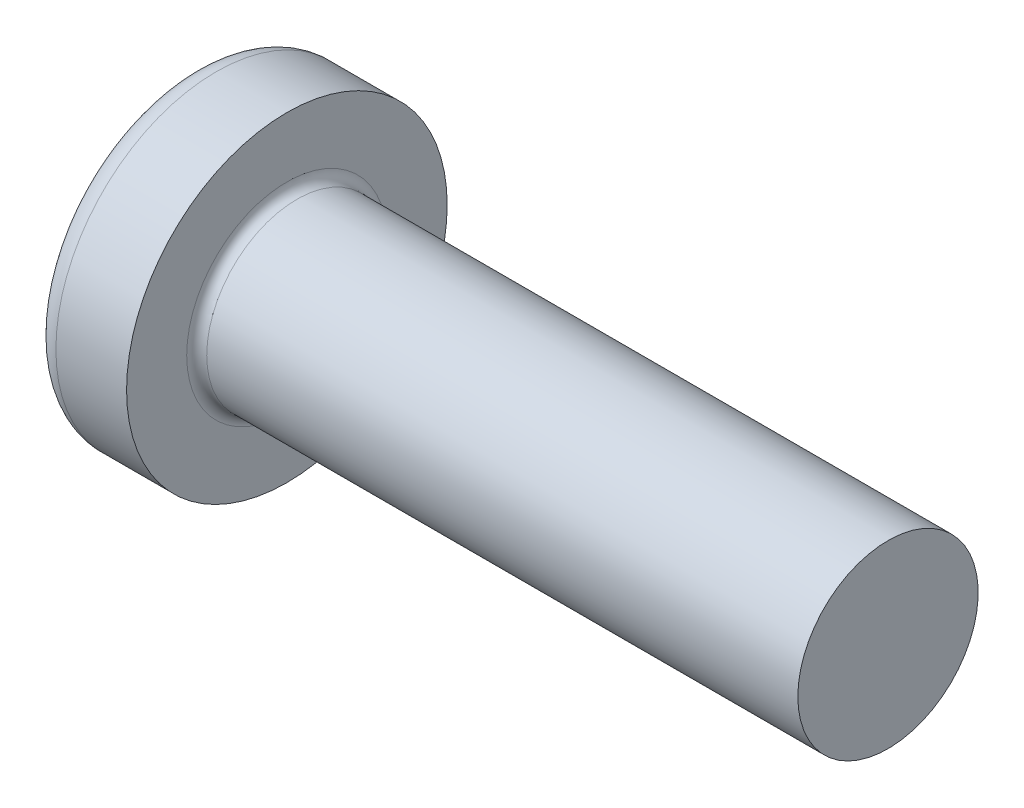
ISO-10303-21;
HEADER;
FILE_DESCRIPTION(('STEP AP214'),'2;1');
FILE_NAME('part.step','',(''),(''),'','','');
FILE_SCHEMA(('AUTOMOTIVE_DESIGN { 1 0 10303 214 1 1 1 1 }'));
ENDSEC;
DATA;
#1=APPLICATION_CONTEXT('core data for automotive mechanical design processes');
#2=APPLICATION_PROTOCOL_DEFINITION('international standard','automotive_design',2000,#1);
#3=PRODUCT_CONTEXT('',#1,'mechanical');
#4=PRODUCT('Part','Part','',(#3));
#5=PRODUCT_RELATED_PRODUCT_CATEGORY('part','',(#4));
#6=PRODUCT_DEFINITION_FORMATION('','',#4);
#7=PRODUCT_DEFINITION_CONTEXT('part definition',#1,'design');
#8=PRODUCT_DEFINITION('design','',#6,#7);
#9=PRODUCT_DEFINITION_SHAPE('','',#8);
#10=(LENGTH_UNIT() NAMED_UNIT(*) SI_UNIT(.MILLI.,.METRE.));
#11=(NAMED_UNIT(*) PLANE_ANGLE_UNIT() SI_UNIT($,.RADIAN.));
#12=(NAMED_UNIT(*) SI_UNIT($,.STERADIAN.) SOLID_ANGLE_UNIT());
#13=UNCERTAINTY_MEASURE_WITH_UNIT(LENGTH_MEASURE(1.E-05),#10,'distance_accuracy_value','');
#14=(GEOMETRIC_REPRESENTATION_CONTEXT(3) GLOBAL_UNCERTAINTY_ASSIGNED_CONTEXT((#13)) GLOBAL_UNIT_ASSIGNED_CONTEXT((#10,
#11,#12)) REPRESENTATION_CONTEXT('',''));
#15=CARTESIAN_POINT('',(0.,0.,0.));
#16=DIRECTION('',(0.,0.,1.));
#17=DIRECTION('',(1.,0.,0.));
#18=AXIS2_PLACEMENT_3D('',#15,#16,#17);
#19=CARTESIAN_POINT('',(0.999999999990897,0.,0.));
#20=DIRECTION('',(-1.,0.,0.));
#21=DIRECTION('',(0.,-1.,0.));
#22=AXIS2_PLACEMENT_3D('',#19,#20,#21);
#23=CONICAL_SURFACE('',#22,0.55599999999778,1.2566370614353);
#24=CARTESIAN_POINT('',(1.18065535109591,0.,2.66453525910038E-12));
#25=VERTEX_POINT('',#24);
#26=VERTEX_LOOP('',#25);
#27=FACE_BOUND('',#26,.T.);
#28=CARTESIAN_POINT('',(0.999999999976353,0.,0.));
#29=DIRECTION('',(-1.,0.,0.));
#30=DIRECTION('',(0.,0.,1.));
#31=AXIS2_PLACEMENT_3D('',#28,#29,#30);
#32=CIRCLE('',#31,0.555999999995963);
#33=CARTESIAN_POINT('',(0.999999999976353,0.,0.555999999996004));
#34=VERTEX_POINT('',#33);
#35=EDGE_CURVE('E284',#34,#34,#32,.T.);
#36=ORIENTED_EDGE('',*,*,#35,.T.);
#37=EDGE_LOOP('',(#36));
#38=FACE_BOUND('',#37,.T.);
#39=ADVANCED_FACE('F16',(#27,#38),#23,.F.);
#40=CARTESIAN_POINT('',(0.999999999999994,0.381418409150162,-0.299999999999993));
#41=DIRECTION('',(0.,0.,1.));
#42=DIRECTION('',(0.,-1.,0.));
#43=AXIS2_PLACEMENT_3D('',#40,#41,#42);
#44=PLANE('',#43);
#45=CARTESIAN_POINT('',(0.791562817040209,-0.485341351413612,-0.299999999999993));
#46=CARTESIAN_POINT('',(0.667770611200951,-0.495508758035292,-0.299999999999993));
#47=CARTESIAN_POINT('',(0.543972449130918,-0.505602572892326,-0.299999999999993));
#48=CARTESIAN_POINT('',(0.296364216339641,-0.525643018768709,-0.299999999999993));
#49=CARTESIAN_POINT('',(0.172554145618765,-0.535589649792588,-0.299999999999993));
#50=CARTESIAN_POINT('',(0.048738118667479,-0.545462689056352,-0.299999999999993));
#51=B_SPLINE_CURVE_WITH_KNOTS('',3,(#45,#46,#47,#48,#49,#50),.UNSPECIFIED.,.F.,.F.,(4,2,4),(0.,
0.372626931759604,0.745253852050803),.UNSPECIFIED.);
#52=CARTESIAN_POINT('',(0.791562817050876,-0.485341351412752,-0.299999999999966));
#53=VERTEX_POINT('',#52);
#54=CARTESIAN_POINT('',(0.048738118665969,-0.545462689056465,-0.299999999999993));
#55=VERTEX_POINT('',#54);
#56=EDGE_CURVE('E231',#53,#55,#51,.T.);
#57=ORIENTED_EDGE('',*,*,#56,.T.);
#58=CARTESIAN_POINT('',(0.0987409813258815,-0.830769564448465,-0.299999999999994));
#59=CARTESIAN_POINT('',(0.0886800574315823,-0.783521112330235,-0.299999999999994));
#60=CARTESIAN_POINT('',(0.0794826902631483,-0.736121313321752,-0.299999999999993));
#61=CARTESIAN_POINT('',(0.0628150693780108,-0.641019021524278,-0.299999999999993));
#62=CARTESIAN_POINT('',(0.0553448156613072,-0.593316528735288,-0.299999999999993));
#63=CARTESIAN_POINT('',(0.0487381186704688,-0.545462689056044,-0.299999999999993));
#64=B_SPLINE_CURVE_WITH_KNOTS('',3,(#58,#59,#60,#61,#62,#63),.UNSPECIFIED.,.F.,.F.,(4,2,4),(0.,
0.144851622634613,0.289703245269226),.UNSPECIFIED.);
#65=CARTESIAN_POINT('',(0.0987409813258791,-0.830769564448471,-0.299999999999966));
#66=VERTEX_POINT('',#65);
#67=EDGE_CURVE('E247',#66,#55,#64,.T.);
#68=ORIENTED_EDGE('',*,*,#67,.F.);
#69=DIRECTION('',(0.89493436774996,0.446197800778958,0.));
#70=VECTOR('',#69,1.);
#71=CARTESIAN_POINT('',(0.999999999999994,-0.381418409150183,-0.299999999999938));
#72=LINE('',#71,#70);
#73=EDGE_CURVE('E257',#66,#53,#72,.T.);
#74=ORIENTED_EDGE('',*,*,#73,.T.);
#75=EDGE_LOOP('',(#57,#68,#74));
#76=FACE_BOUND('',#75,.T.);
#77=ADVANCED_FACE('F239',(#76),#44,.T.);
#78=CARTESIAN_POINT('',(0.999999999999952,-0.300000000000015,-0.381418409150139));
#79=DIRECTION('',(0.,1.,0.));
#80=DIRECTION('',(0.,0.,1.));
#81=AXIS2_PLACEMENT_3D('',#78,#79,#80);
#82=PLANE('',#81);
#83=CARTESIAN_POINT('',(0.0487381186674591,-0.300000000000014,-0.545462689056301));
#84=CARTESIAN_POINT('',(0.172554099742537,-0.300000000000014,-0.53558965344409));
#85=CARTESIAN_POINT('',(0.296364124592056,-0.300000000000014,-0.525643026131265));
#86=CARTESIAN_POINT('',(0.543972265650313,-0.300000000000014,-0.505602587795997));
#87=CARTESIAN_POINT('',(0.667770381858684,-0.300000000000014,-0.495508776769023));
#88=CARTESIAN_POINT('',(0.79156254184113,-0.300000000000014,-0.485341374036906));
#89=B_SPLINE_CURVE_WITH_KNOTS('',3,(#83,#84,#85,#86,#87,#88),.UNSPECIFIED.,.F.,.F.,(4,2,4),(0.,
0.372626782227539,0.745253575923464),.UNSPECIFIED.);
#90=CARTESIAN_POINT('',(0.0487381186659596,-0.300000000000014,-0.545462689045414));
#91=VERTEX_POINT('',#90);
#92=CARTESIAN_POINT('',(0.79156267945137,-0.300000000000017,-0.485341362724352));
#93=VERTEX_POINT('',#92);
#94=EDGE_CURVE('E225',#91,#93,#89,.T.);
#95=ORIENTED_EDGE('',*,*,#94,.T.);
#96=DIRECTION('',(-0.894934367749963,0.,-0.446197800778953));
#97=VECTOR('',#96,1.);
#98=CARTESIAN_POINT('',(0.999999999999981,-0.30000000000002,-0.381418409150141));
#99=LINE('',#98,#97);
#100=CARTESIAN_POINT('',(0.0987409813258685,-0.300000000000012,-0.830769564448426));
#101=VERTEX_POINT('',#100);
#102=EDGE_CURVE('E282',#93,#101,#99,.T.);
#103=ORIENTED_EDGE('',*,*,#102,.T.);
#104=CARTESIAN_POINT('',(4.,-0.300000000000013,0.));
#105=DIRECTION('',(0.,1.,0.));
#106=DIRECTION('',(0.,0.,1.));
#107=AXIS2_PLACEMENT_3D('',#104,#105,#106);
#108=CIRCLE('',#107,3.98873413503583);
#109=EDGE_CURVE('E568',#91,#101,#108,.F.);
#110=ORIENTED_EDGE('',*,*,#109,.F.);
#111=EDGE_LOOP('',(#95,#103,#110));
#112=FACE_BOUND('',#111,.T.);
#113=ADVANCED_FACE('F235',(#112),#82,.T.);
#114=CARTESIAN_POINT('',(0.99999999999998,0.299999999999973,-0.381418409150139));
#115=DIRECTION('',(0.446197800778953,0.,-0.894934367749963));
#116=DIRECTION('',(-0.894934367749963,0.,-0.446197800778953));
#117=AXIS2_PLACEMENT_3D('',#114,#115,#116);
#118=PLANE('',#117);
#119=DIRECTION('',(0.894934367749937,0.,0.446197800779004));
#120=VECTOR('',#119,1.);
#121=CARTESIAN_POINT('',(0.0987409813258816,0.299999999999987,-0.830769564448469));
#122=LINE('',#121,#120);
#123=CARTESIAN_POINT('',(0.0987409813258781,0.299999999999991,-0.830769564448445));
#124=VERTEX_POINT('',#123);
#125=CARTESIAN_POINT('',(0.79156281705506,0.299999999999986,-0.485341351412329));
#126=VERTEX_POINT('',#125);
#127=EDGE_CURVE('E279',#124,#126,#122,.T.);
#128=ORIENTED_EDGE('',*,*,#127,.F.);
#129=CARTESIAN_POINT('',(0.0987409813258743,-0.30000000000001,-0.830769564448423));
#130=CARTESIAN_POINT('',(0.0917996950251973,-0.20000000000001,-0.834230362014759));
#131=CARTESIAN_POINT('',(0.0883290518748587,-0.100000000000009,-0.835960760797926));
#132=CARTESIAN_POINT('',(0.0883290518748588,0.0999999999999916,-0.835960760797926));
#133=CARTESIAN_POINT('',(0.0917996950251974,0.199999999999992,-0.834230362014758));
#134=CARTESIAN_POINT('',(0.0987409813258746,0.299999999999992,-0.830769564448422));
#135=B_SPLINE_CURVE_WITH_KNOTS('',3,(#129,#130,#131,#132,#133,#134),.UNSPECIFIED.,.F.,.F.,(4,2,
4),(0.,0.30022550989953,0.60045101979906),.UNSPECIFIED.);
#136=EDGE_CURVE('E146',#101,#124,#135,.T.);
#137=ORIENTED_EDGE('',*,*,#136,.F.);
#138=ORIENTED_EDGE('',*,*,#102,.F.);
#139=CARTESIAN_POINT('',(1.62081539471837,0.,-0.071891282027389));
#140=DIRECTION('',(0.446197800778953,0.,-0.894934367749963));
#141=DIRECTION('',(-0.894934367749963,0.,-0.446197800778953));
#142=AXIS2_PLACEMENT_3D('',#139,#140,#141);
#143=ELLIPSE('',#142,1.14879176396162,0.507521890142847);
#144=EDGE_CURVE('E230',#93,#126,#143,.T.);
#145=ORIENTED_EDGE('',*,*,#144,.T.);
#146=EDGE_LOOP('',(#128,#137,#138,#145));
#147=FACE_BOUND('',#146,.T.);
#148=ADVANCED_FACE('F238',(#147),#118,.F.);
#149=CARTESIAN_POINT('',(1.00000000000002,0.299999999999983,0.381418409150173));
#150=DIRECTION('',(0.,-1.,0.));
#151=DIRECTION('',(0.,0.,-1.));
#152=AXIS2_PLACEMENT_3D('',#149,#150,#151);
#153=PLANE('',#152);
#154=CARTESIAN_POINT('',(0.79156281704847,0.299999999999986,-0.48534135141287));
#155=CARTESIAN_POINT('',(0.667770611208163,0.299999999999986,-0.495508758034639));
#156=CARTESIAN_POINT('',(0.54397244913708,0.299999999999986,-0.505602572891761));
#157=CARTESIAN_POINT('',(0.296364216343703,0.299999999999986,-0.525643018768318));
#158=CARTESIAN_POINT('',(0.172554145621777,0.299999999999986,-0.535589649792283));
#159=CARTESIAN_POINT('',(0.0487381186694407,0.299999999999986,-0.54546268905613));
#160=B_SPLINE_CURVE_WITH_KNOTS('',3,(#154,#155,#156,#157,#158,#159),.UNSPECIFIED.,.F.,.F.,(4,2,
4),(0.,0.372626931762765,0.745253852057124),.UNSPECIFIED.);
#161=CARTESIAN_POINT('',(0.04873811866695,0.299999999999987,-0.545462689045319));
#162=VERTEX_POINT('',#161);
#163=EDGE_CURVE('E139',#126,#162,#160,.T.);
#164=ORIENTED_EDGE('',*,*,#163,.T.);
#165=CARTESIAN_POINT('',(4.,0.299999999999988,0.));
#166=DIRECTION('',(0.,1.,0.));
#167=DIRECTION('',(0.,0.,1.));
#168=AXIS2_PLACEMENT_3D('',#165,#166,#167);
#169=CIRCLE('',#168,3.98873413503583);
#170=EDGE_CURVE('E126',#124,#162,#169,.T.);
#171=ORIENTED_EDGE('',*,*,#170,.F.);
#172=ORIENTED_EDGE('',*,*,#127,.T.);
#173=EDGE_LOOP('',(#164,#171,#172));
#174=FACE_BOUND('',#173,.T.);
#175=ADVANCED_FACE('F167',(#174),#153,.T.);
#176=CARTESIAN_POINT('',(0.999999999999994,0.381418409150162,-0.299999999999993));
#177=DIRECTION('',(0.,0.,1.));
#178=DIRECTION('',(0.,-1.,0.));
#179=AXIS2_PLACEMENT_3D('',#176,#177,#178);
#180=PLANE('',#179);
#181=CARTESIAN_POINT('',(0.0487381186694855,0.54546268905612,-0.299999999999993));
#182=CARTESIAN_POINT('',(0.172554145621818,0.535589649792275,-0.299999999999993));
#183=CARTESIAN_POINT('',(0.296364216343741,0.525643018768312,-0.299999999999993));
#184=CARTESIAN_POINT('',(0.543972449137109,0.505602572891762,-0.299999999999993));
#185=CARTESIAN_POINT('',(0.667770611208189,0.495508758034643,-0.299999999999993));
#186=CARTESIAN_POINT('',(0.791562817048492,0.485341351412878,-0.299999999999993));
#187=B_SPLINE_CURVE_WITH_KNOTS('',3,(#181,#182,#183,#184,#185,#186),.UNSPECIFIED.,.F.,.F.,(4,2,
4),(0.,0.372626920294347,0.7452538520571),.UNSPECIFIED.);
#188=CARTESIAN_POINT('',(0.0487381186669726,0.545462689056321,-0.299999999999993));
#189=VERTEX_POINT('',#188);
#190=CARTESIAN_POINT('',(0.7915628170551,0.485341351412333,-0.299999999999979));
#191=VERTEX_POINT('',#190);
#192=EDGE_CURVE('E130',#189,#191,#187,.T.);
#193=ORIENTED_EDGE('',*,*,#192,.T.);
#194=DIRECTION('',(-0.89493436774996,0.446197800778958,0.));
#195=VECTOR('',#194,1.);
#196=CARTESIAN_POINT('',(1.00000000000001,0.381418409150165,-0.299999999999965));
#197=LINE('',#196,#195);
#198=CARTESIAN_POINT('',(0.0987409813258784,0.830769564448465,-0.299999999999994));
#199=VERTEX_POINT('',#198);
#200=EDGE_CURVE('E138',#191,#199,#197,.T.);
#201=ORIENTED_EDGE('',*,*,#200,.T.);
#202=CARTESIAN_POINT('',(0.0487381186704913,0.545462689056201,-0.299999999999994));
#203=CARTESIAN_POINT('',(0.0553448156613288,0.593316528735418,-0.299999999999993));
#204=CARTESIAN_POINT('',(0.0628150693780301,0.641019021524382,-0.299999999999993));
#205=CARTESIAN_POINT('',(0.0794826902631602,0.736121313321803,-0.299999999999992));
#206=CARTESIAN_POINT('',(0.088680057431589,0.78352111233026,-0.299999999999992));
#207=CARTESIAN_POINT('',(0.0987409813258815,0.830769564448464,-0.299999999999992));
#208=B_SPLINE_CURVE_WITH_KNOTS('',3,(#202,#203,#204,#205,#206,#207),.UNSPECIFIED.,.F.,.F.,(4,2,
4),(0.,0.144851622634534,0.289703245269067),.UNSPECIFIED.);
#209=EDGE_CURVE('E123',#189,#199,#208,.T.);
#210=ORIENTED_EDGE('',*,*,#209,.F.);
#211=EDGE_LOOP('',(#193,#201,#210));
#212=FACE_BOUND('',#211,.T.);
#213=ADVANCED_FACE('F141',(#212),#180,.T.);
#214=CARTESIAN_POINT('',(1.00000000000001,0.381418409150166,0.30000000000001));
#215=DIRECTION('',(0.446197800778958,0.89493436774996,0.));
#216=DIRECTION('',(-0.89493436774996,0.446197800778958,0.));
#217=AXIS2_PLACEMENT_3D('',#214,#215,#216);
#218=PLANE('',#217);
#219=DIRECTION('',(0.894934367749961,-0.446197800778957,0.));
#220=VECTOR('',#219,1.);
#221=CARTESIAN_POINT('',(0.0987409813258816,0.830769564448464,0.300000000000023));
#222=LINE('',#221,#220);
#223=CARTESIAN_POINT('',(0.0987409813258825,0.830769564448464,0.300000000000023));
#224=VERTEX_POINT('',#223);
#225=CARTESIAN_POINT('',(0.791562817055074,0.48534135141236,0.300000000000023));
#226=VERTEX_POINT('',#225);
#227=EDGE_CURVE('E275',#224,#226,#222,.T.);
#228=ORIENTED_EDGE('',*,*,#227,.F.);
#229=CARTESIAN_POINT('',(0.0987409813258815,0.830769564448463,-0.299999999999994));
#230=CARTESIAN_POINT('',(0.0917996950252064,0.834230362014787,-0.199999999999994));
#231=CARTESIAN_POINT('',(0.0883290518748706,0.835960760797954,-0.0999999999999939));
#232=CARTESIAN_POINT('',(0.0883290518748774,0.835960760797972,0.100000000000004));
#233=CARTESIAN_POINT('',(0.0917996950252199,0.834230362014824,0.200000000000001));
#234=CARTESIAN_POINT('',(0.0987409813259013,0.830769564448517,0.299999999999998));
#235=B_SPLINE_CURVE_WITH_KNOTS('',3,(#229,#230,#231,#232,#233,#234),.UNSPECIFIED.,.F.,.F.,(4,2,
4),(0.,0.300225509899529,0.600451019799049),.UNSPECIFIED.);
#236=EDGE_CURVE('E142',#199,#224,#235,.T.);
#237=ORIENTED_EDGE('',*,*,#236,.F.);
#238=ORIENTED_EDGE('',*,*,#200,.F.);
#239=CARTESIAN_POINT('',(1.62081539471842,0.0718912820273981,0.));
#240=DIRECTION('',(0.446197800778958,0.89493436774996,0.));
#241=DIRECTION('',(-0.89493436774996,0.446197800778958,0.));
#242=AXIS2_PLACEMENT_3D('',#239,#240,#241);
#243=ELLIPSE('',#242,1.1487917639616,0.507521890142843);
#244=EDGE_CURVE('E134',#226,#191,#243,.F.);
#245=ORIENTED_EDGE('',*,*,#244,.F.);
#246=EDGE_LOOP('',(#228,#237,#238,#245));
#247=FACE_BOUND('',#246,.T.);
#248=ADVANCED_FACE('F166',(#247),#218,.F.);
#249=CARTESIAN_POINT('',(0.999999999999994,-0.38141840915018,0.300000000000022));
#250=DIRECTION('',(0.,0.,-1.));
#251=DIRECTION('',(0.,1.,0.));
#252=AXIS2_PLACEMENT_3D('',#249,#250,#251);
#253=PLANE('',#252);
#254=CARTESIAN_POINT('',(0.791562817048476,0.485341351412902,0.300000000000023));
#255=CARTESIAN_POINT('',(0.667770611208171,0.49550875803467,0.300000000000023));
#256=CARTESIAN_POINT('',(0.543972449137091,0.505602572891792,0.300000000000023));
#257=CARTESIAN_POINT('',(0.29636421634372,0.525643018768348,0.300000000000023));
#258=CARTESIAN_POINT('',(0.172554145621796,0.535589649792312,0.300000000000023));
#259=CARTESIAN_POINT('',(0.0487381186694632,0.545462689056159,0.300000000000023));
#260=B_SPLINE_CURVE_WITH_KNOTS('',3,(#254,#255,#256,#257,#258,#259),.UNSPECIFIED.,.F.,.F.,(4,2,
4),(0.,0.372626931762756,0.745253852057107),.UNSPECIFIED.);
#261=CARTESIAN_POINT('',(0.0487381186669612,0.545462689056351,0.300000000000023));
#262=VERTEX_POINT('',#261);
#263=EDGE_CURVE('E211',#226,#262,#260,.T.);
#264=ORIENTED_EDGE('',*,*,#263,.T.);
#265=CARTESIAN_POINT('',(0.0987409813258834,0.830769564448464,0.300000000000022));
#266=CARTESIAN_POINT('',(0.0886800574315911,0.783521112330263,0.300000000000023));
#267=CARTESIAN_POINT('',(0.0794826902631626,0.736121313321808,0.300000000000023));
#268=CARTESIAN_POINT('',(0.0628150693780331,0.641019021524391,0.300000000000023));
#269=CARTESIAN_POINT('',(0.0553448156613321,0.59331652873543,0.300000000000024));
#270=CARTESIAN_POINT('',(0.0487381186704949,0.545462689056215,0.300000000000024));
#271=B_SPLINE_CURVE_WITH_KNOTS('',3,(#265,#266,#267,#268,#269,#270),.UNSPECIFIED.,.F.,.F.,(4,2,
4),(0.,0.144851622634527,0.289703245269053),.UNSPECIFIED.);
#272=EDGE_CURVE('E144',#224,#262,#271,.T.);
#273=ORIENTED_EDGE('',*,*,#272,.F.);
#274=ORIENTED_EDGE('',*,*,#227,.T.);
#275=EDGE_LOOP('',(#264,#273,#274));
#276=FACE_BOUND('',#275,.T.);
#277=ADVANCED_FACE('F507',(#276),#253,.T.);
#278=CARTESIAN_POINT('',(1.00000000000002,0.299999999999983,0.381418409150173));
#279=DIRECTION('',(0.,-1.,0.));
#280=DIRECTION('',(0.,0.,-1.));
#281=AXIS2_PLACEMENT_3D('',#278,#279,#280);
#282=PLANE('',#281);
#283=CARTESIAN_POINT('',(0.0487381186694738,0.299999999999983,0.545462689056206));
#284=CARTESIAN_POINT('',(0.17255414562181,0.299999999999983,0.53558964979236));
#285=CARTESIAN_POINT('',(0.296364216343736,0.299999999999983,0.525643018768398));
#286=CARTESIAN_POINT('',(0.543972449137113,0.299999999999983,0.505602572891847));
#287=CARTESIAN_POINT('',(0.667770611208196,0.299999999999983,0.495508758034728));
#288=CARTESIAN_POINT('',(0.791562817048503,0.299999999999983,0.485341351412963));
#289=B_SPLINE_CURVE_WITH_KNOTS('',3,(#283,#284,#285,#286,#287,#288),.UNSPECIFIED.,.F.,.F.,(4,2,
4),(0.,0.372626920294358,0.745253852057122),.UNSPECIFIED.);
#290=CARTESIAN_POINT('',(0.048738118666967,0.299999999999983,0.545462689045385));
#291=VERTEX_POINT('',#290);
#292=CARTESIAN_POINT('',(0.791562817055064,0.29999999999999,0.485341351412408));
#293=VERTEX_POINT('',#292);
#294=EDGE_CURVE('E205',#291,#293,#289,.T.);
#295=ORIENTED_EDGE('',*,*,#294,.T.);
#296=DIRECTION('',(0.894934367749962,0.,-0.446197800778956));
#297=VECTOR('',#296,1.);
#298=CARTESIAN_POINT('',(0.999999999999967,0.299999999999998,0.38141840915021));
#299=LINE('',#298,#297);
#300=CARTESIAN_POINT('',(0.0987409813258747,0.299999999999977,0.830769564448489));
#301=VERTEX_POINT('',#300);
#302=EDGE_CURVE('E273',#293,#301,#299,.F.);
#303=ORIENTED_EDGE('',*,*,#302,.T.);
#304=CARTESIAN_POINT('',(4.,0.299999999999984,0.));
#305=DIRECTION('',(0.,1.,0.));
#306=DIRECTION('',(0.,0.,1.));
#307=AXIS2_PLACEMENT_3D('',#304,#305,#306);
#308=CIRCLE('',#307,3.98873413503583);
#309=EDGE_CURVE('E587',#291,#301,#308,.T.);
#310=ORIENTED_EDGE('',*,*,#309,.F.);
#311=EDGE_LOOP('',(#295,#303,#310));
#312=FACE_BOUND('',#311,.T.);
#313=ADVANCED_FACE('F498',(#312),#282,.T.);
#314=CARTESIAN_POINT('',(0.999999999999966,-0.300000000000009,0.381418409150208));
#315=DIRECTION('',(0.446197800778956,0.,0.894934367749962));
#316=DIRECTION('',(0.894934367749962,0.,-0.446197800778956));
#317=AXIS2_PLACEMENT_3D('',#314,#315,#316);
#318=PLANE('',#317);
#319=DIRECTION('',(0.894934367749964,0.,-0.446197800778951));
#320=VECTOR('',#319,1.);
#321=CARTESIAN_POINT('',(0.0987409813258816,-0.300000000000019,0.830769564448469));
#322=LINE('',#321,#320);
#323=CARTESIAN_POINT('',(0.0987409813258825,-0.300000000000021,0.830769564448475));
#324=VERTEX_POINT('',#323);
#325=CARTESIAN_POINT('',(0.791562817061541,-0.300000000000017,0.485341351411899));
#326=VERTEX_POINT('',#325);
#327=EDGE_CURVE('E269',#324,#326,#322,.T.);
#328=ORIENTED_EDGE('',*,*,#327,.F.);
#329=CARTESIAN_POINT('',(0.0987409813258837,0.299999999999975,0.830769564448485));
#330=CARTESIAN_POINT('',(0.0917996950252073,0.199999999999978,0.83423036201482));
#331=CARTESIAN_POINT('',(0.088329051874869,0.09999999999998,0.835960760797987));
#332=CARTESIAN_POINT('',(0.088329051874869,-0.100000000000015,0.835960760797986));
#333=CARTESIAN_POINT('',(0.0917996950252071,-0.200000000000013,0.834230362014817));
#334=CARTESIAN_POINT('',(0.0987409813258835,-0.30000000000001,0.830769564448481));
#335=B_SPLINE_CURVE_WITH_KNOTS('',3,(#329,#330,#331,#332,#333,#334),.UNSPECIFIED.,.F.,.F.,(4,2,
4),(0.,0.300225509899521,0.600451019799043),.UNSPECIFIED.);
#336=EDGE_CURVE('E585',#301,#324,#335,.T.);
#337=ORIENTED_EDGE('',*,*,#336,.F.);
#338=ORIENTED_EDGE('',*,*,#302,.F.);
#339=CARTESIAN_POINT('',(1.62081539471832,0.,0.0718912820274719));
#340=DIRECTION('',(0.446197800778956,0.,0.894934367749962));
#341=DIRECTION('',(-0.894934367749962,0.,0.446197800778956));
#342=AXIS2_PLACEMENT_3D('',#339,#340,#341);
#343=ELLIPSE('',#342,1.14879176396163,0.50752189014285);
#344=EDGE_CURVE('E272',#293,#326,#343,.T.);
#345=ORIENTED_EDGE('',*,*,#344,.T.);
#346=EDGE_LOOP('',(#328,#337,#338,#345));
#347=FACE_BOUND('',#346,.T.);
#348=ADVANCED_FACE('F489',(#347),#318,.F.);
#349=CARTESIAN_POINT('',(0.999999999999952,-0.300000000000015,-0.381418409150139));
#350=DIRECTION('',(0.,1.,0.));
#351=DIRECTION('',(0.,0.,1.));
#352=AXIS2_PLACEMENT_3D('',#349,#350,#351);
#353=PLANE('',#352);
#354=CARTESIAN_POINT('',(0.79156281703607,-0.300000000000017,0.485341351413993));
#355=CARTESIAN_POINT('',(0.667770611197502,-0.300000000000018,0.495508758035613));
#356=CARTESIAN_POINT('',(0.543972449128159,-0.300000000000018,0.505602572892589));
#357=CARTESIAN_POINT('',(0.296364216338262,-0.300000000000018,0.525643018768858));
#358=CARTESIAN_POINT('',(0.172554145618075,-0.300000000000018,0.535589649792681));
#359=CARTESIAN_POINT('',(0.0487381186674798,-0.300000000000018,0.545462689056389));
#360=B_SPLINE_CURVE_WITH_KNOTS('',3,(#354,#355,#356,#357,#358,#359),.UNSPECIFIED.,.F.,.F.,(4,2,
4),(0.,0.372626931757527,0.745253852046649),.UNSPECIFIED.);
#361=CARTESIAN_POINT('',(0.0487381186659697,-0.300000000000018,0.545462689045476));
#362=VERTEX_POINT('',#361);
#363=EDGE_CURVE('E196',#326,#362,#360,.T.);
#364=ORIENTED_EDGE('',*,*,#363,.T.);
#365=CARTESIAN_POINT('',(4.,-0.300000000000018,0.));
#366=DIRECTION('',(0.,1.,0.));
#367=DIRECTION('',(0.,0.,1.));
#368=AXIS2_PLACEMENT_3D('',#365,#366,#367);
#369=CIRCLE('',#368,3.98873413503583);
#370=EDGE_CURVE('E580',#324,#362,#369,.F.);
#371=ORIENTED_EDGE('',*,*,#370,.F.);
#372=ORIENTED_EDGE('',*,*,#327,.T.);
#373=EDGE_LOOP('',(#364,#371,#372));
#374=FACE_BOUND('',#373,.T.);
#375=ADVANCED_FACE('F189',(#374),#353,.T.);
#376=CARTESIAN_POINT('',(0.0487381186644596,0.,0.));
#377=DIRECTION('',(-1.,0.,0.));
#378=DIRECTION('',(0.,0.,1.));
#379=AXIS2_PLACEMENT_3D('',#376,#377,#378);
#380=CONICAL_SURFACE('',#379,0.62251871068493,0.0698131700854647);
#381=ORIENTED_EDGE('',*,*,#344,.F.);
#382=ORIENTED_EDGE('',*,*,#294,.F.);
#383=CARTESIAN_POINT('',(0.0487381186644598,0.,0.));
#384=DIRECTION('',(-1.,0.,0.));
#385=DIRECTION('',(0.,0.,1.));
#386=AXIS2_PLACEMENT_3D('',#383,#384,#385);
#387=CIRCLE('',#386,0.62251871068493);
#388=EDGE_CURVE('E127',#262,#291,#387,.F.);
#389=ORIENTED_EDGE('',*,*,#388,.F.);
#390=ORIENTED_EDGE('',*,*,#263,.F.);
#391=ORIENTED_EDGE('',*,*,#244,.T.);
#392=ORIENTED_EDGE('',*,*,#192,.F.);
#393=CARTESIAN_POINT('',(0.0487381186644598,0.,0.));
#394=DIRECTION('',(-1.,0.,0.));
#395=DIRECTION('',(0.,0.,1.));
#396=AXIS2_PLACEMENT_3D('',#393,#394,#395);
#397=CIRCLE('',#396,0.62251871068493);
#398=EDGE_CURVE('E114',#162,#189,#397,.F.);
#399=ORIENTED_EDGE('',*,*,#398,.F.);
#400=ORIENTED_EDGE('',*,*,#163,.F.);
#401=ORIENTED_EDGE('',*,*,#144,.F.);
#402=ORIENTED_EDGE('',*,*,#94,.F.);
#403=CARTESIAN_POINT('',(0.0487381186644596,0.,0.));
#404=DIRECTION('',(-1.,0.,0.));
#405=DIRECTION('',(0.,0.,1.));
#406=AXIS2_PLACEMENT_3D('',#403,#404,#405);
#407=CIRCLE('',#406,0.62251871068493);
#408=EDGE_CURVE('E253',#55,#91,#407,.F.);
#409=ORIENTED_EDGE('',*,*,#408,.F.);
#410=ORIENTED_EDGE('',*,*,#56,.F.);
#411=CARTESIAN_POINT('',(1.62081539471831,-0.0718912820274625,0.));
#412=DIRECTION('',(0.446197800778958,-0.89493436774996,0.));
#413=DIRECTION('',(-0.89493436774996,-0.446197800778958,0.));
#414=AXIS2_PLACEMENT_3D('',#411,#412,#413);
#415=ELLIPSE('',#414,1.14879176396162,0.507521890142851);
#416=CARTESIAN_POINT('',(0.791562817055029,-0.485341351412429,0.30000000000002));
#417=VERTEX_POINT('',#416);
#418=EDGE_CURVE('E254',#53,#417,#415,.F.);
#419=ORIENTED_EDGE('',*,*,#418,.T.);
#420=CARTESIAN_POINT('',(0.0487381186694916,-0.545462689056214,0.300000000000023));
#421=CARTESIAN_POINT('',(0.172554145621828,-0.535589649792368,0.300000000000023));
#422=CARTESIAN_POINT('',(0.296364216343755,-0.525643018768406,0.300000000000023));
#423=CARTESIAN_POINT('',(0.543972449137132,-0.505602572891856,0.300000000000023));
#424=CARTESIAN_POINT('',(0.667770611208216,-0.495508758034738,0.300000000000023));
#425=CARTESIAN_POINT('',(0.791562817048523,-0.485341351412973,0.300000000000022));
#426=B_SPLINE_CURVE_WITH_KNOTS('',3,(#420,#421,#422,#423,#424,#425),.UNSPECIFIED.,.F.,.F.,(4,2,
4),(0.,0.372626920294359,0.745253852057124),.UNSPECIFIED.);
#427=CARTESIAN_POINT('',(0.0487381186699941,-0.545462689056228,0.300000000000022));
#428=VERTEX_POINT('',#427);
#429=EDGE_CURVE('E218',#428,#417,#426,.T.);
#430=ORIENTED_EDGE('',*,*,#429,.F.);
#431=CARTESIAN_POINT('',(0.0487381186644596,0.,0.));
#432=DIRECTION('',(-1.,0.,0.));
#433=DIRECTION('',(0.,0.,1.));
#434=AXIS2_PLACEMENT_3D('',#431,#432,#433);
#435=CIRCLE('',#434,0.62251871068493);
#436=EDGE_CURVE('E578',#362,#428,#435,.F.);
#437=ORIENTED_EDGE('',*,*,#436,.F.);
#438=ORIENTED_EDGE('',*,*,#363,.F.);
#439=EDGE_LOOP('',(#381,#382,#389,#390,#391,#392,#399,#400,#401,#402,#409,#410,#419,#430,#437,#438));
#440=FACE_BOUND('',#439,.T.);
#441=ORIENTED_EDGE('',*,*,#35,.F.);
#442=EDGE_LOOP('',(#441));
#443=FACE_BOUND('',#442,.T.);
#444=ADVANCED_FACE('F131',(#440,#443),#380,.F.);
#445=CARTESIAN_POINT('',(0.999999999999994,-0.38141840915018,0.300000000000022));
#446=DIRECTION('',(0.,0.,-1.));
#447=DIRECTION('',(0.,1.,0.));
#448=AXIS2_PLACEMENT_3D('',#445,#446,#447);
#449=PLANE('',#448);
#450=ORIENTED_EDGE('',*,*,#429,.T.);
#451=DIRECTION('',(0.89493436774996,0.446197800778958,0.));
#452=VECTOR('',#451,1.);
#453=CARTESIAN_POINT('',(0.999999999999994,-0.381418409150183,0.300000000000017));
#454=LINE('',#453,#452);
#455=CARTESIAN_POINT('',(0.0987409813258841,-0.830769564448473,0.30000000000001));
#456=VERTEX_POINT('',#455);
#457=EDGE_CURVE('E261',#417,#456,#454,.F.);
#458=ORIENTED_EDGE('',*,*,#457,.T.);
#459=CARTESIAN_POINT('',(0.0487381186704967,-0.545462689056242,0.300000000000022));
#460=CARTESIAN_POINT('',(0.0553448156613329,-0.593316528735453,0.300000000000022));
#461=CARTESIAN_POINT('',(0.0628150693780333,-0.641019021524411,0.300000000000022));
#462=CARTESIAN_POINT('',(0.0794826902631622,-0.736121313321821,0.300000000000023));
#463=CARTESIAN_POINT('',(0.0886800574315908,-0.783521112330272,0.300000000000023));
#464=CARTESIAN_POINT('',(0.0987409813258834,-0.83076956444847,0.300000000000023));
#465=B_SPLINE_CURVE_WITH_KNOTS('',3,(#459,#460,#461,#462,#463,#464),.UNSPECIFIED.,.F.,.F.,(4,2,
4),(0.,0.144851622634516,0.289703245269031),.UNSPECIFIED.);
#466=EDGE_CURVE('E302',#428,#456,#465,.T.);
#467=ORIENTED_EDGE('',*,*,#466,.F.);
#468=EDGE_LOOP('',(#450,#458,#467));
#469=FACE_BOUND('',#468,.T.);
#470=ADVANCED_FACE('F188',(#469),#449,.T.);
#471=CARTESIAN_POINT('',(0.999999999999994,-0.381418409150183,-0.299999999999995));
#472=DIRECTION('',(0.446197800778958,-0.89493436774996,0.));
#473=DIRECTION('',(0.89493436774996,0.446197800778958,0.));
#474=AXIS2_PLACEMENT_3D('',#471,#472,#473);
#475=PLANE('',#474);
#476=ORIENTED_EDGE('',*,*,#73,.F.);
#477=CARTESIAN_POINT('',(0.0987409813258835,-0.830769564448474,0.300000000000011));
#478=CARTESIAN_POINT('',(0.0917996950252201,-0.834230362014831,0.20000000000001));
#479=CARTESIAN_POINT('',(0.0883290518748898,-0.835960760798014,0.10000000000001));
#480=CARTESIAN_POINT('',(0.0883290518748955,-0.835960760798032,-0.0999999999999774));
#481=CARTESIAN_POINT('',(0.0917996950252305,-0.834230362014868,-0.199999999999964));
#482=CARTESIAN_POINT('',(0.0987409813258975,-0.83076956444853,-0.29999999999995));
#483=B_SPLINE_CURVE_WITH_KNOTS('',3,(#477,#478,#479,#480,#481,#482),.UNSPECIFIED.,.F.,.F.,(4,2,
4),(0.,0.300225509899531,0.600451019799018),.UNSPECIFIED.);
#484=EDGE_CURVE('E297',#456,#66,#483,.T.);
#485=ORIENTED_EDGE('',*,*,#484,.F.);
#486=ORIENTED_EDGE('',*,*,#457,.F.);
#487=ORIENTED_EDGE('',*,*,#418,.F.);
#488=EDGE_LOOP('',(#476,#485,#486,#487));
#489=FACE_BOUND('',#488,.T.);
#490=ADVANCED_FACE('F307',(#489),#475,.F.);
#491=CARTESIAN_POINT('',(4.,0.,0.));
#492=DIRECTION('',(0.,1.,0.));
#493=DIRECTION('',(1.,0.,0.));
#494=AXIS2_PLACEMENT_3D('',#491,#492,#493);
#495=SPHERICAL_SURFACE('',#494,4.);
#496=CARTESIAN_POINT('',(0.270825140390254,0.,0.));
#497=DIRECTION('',(-1.,0.,0.));
#498=DIRECTION('',(0.,0.,1.));
#499=AXIS2_PLACEMENT_3D('',#496,#497,#498);
#500=CIRCLE('',#499,1.44680851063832);
#501=CARTESIAN_POINT('',(0.270825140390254,0.,1.44680851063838));
#502=VERTEX_POINT('',#501);
#503=EDGE_CURVE('E293',#502,#502,#500,.F.);
#504=ORIENTED_EDGE('',*,*,#503,.F.);
#505=EDGE_LOOP('',(#504));
#506=FACE_BOUND('',#505,.T.);
#507=ORIENTED_EDGE('',*,*,#466,.T.);
#508=ORIENTED_EDGE('',*,*,#484,.T.);
#509=ORIENTED_EDGE('',*,*,#67,.T.);
#510=ORIENTED_EDGE('',*,*,#408,.T.);
#511=ORIENTED_EDGE('',*,*,#109,.T.);
#512=ORIENTED_EDGE('',*,*,#136,.T.);
#513=ORIENTED_EDGE('',*,*,#170,.T.);
#514=ORIENTED_EDGE('',*,*,#398,.T.);
#515=ORIENTED_EDGE('',*,*,#209,.T.);
#516=ORIENTED_EDGE('',*,*,#236,.T.);
#517=ORIENTED_EDGE('',*,*,#272,.T.);
#518=ORIENTED_EDGE('',*,*,#388,.T.);
#519=ORIENTED_EDGE('',*,*,#309,.T.);
#520=ORIENTED_EDGE('',*,*,#336,.T.);
#521=ORIENTED_EDGE('',*,*,#370,.T.);
#522=ORIENTED_EDGE('',*,*,#436,.T.);
#523=EDGE_LOOP('',(#507,#508,#509,#510,#511,#512,#513,#514,#515,#516,#517,#518,#519,#520,#521,#522));
#524=FACE_BOUND('',#523,.T.);
#525=ADVANCED_FACE('F120',(#506,#524),#495,.T.);
#526=CARTESIAN_POINT('',(0.494575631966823,0.,0.));
#527=DIRECTION('',(-1.,0.,0.));
#528=DIRECTION('',(0.,0.,1.));
#529=AXIS2_PLACEMENT_3D('',#526,#527,#528);
#530=TOROIDAL_SURFACE('',#529,1.36,0.24);
#531=ORIENTED_EDGE('',*,*,#503,.T.);
#532=EDGE_LOOP('',(#531));
#533=FACE_BOUND('',#532,.T.);
#534=CARTESIAN_POINT('',(0.494575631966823,0.,0.));
#535=DIRECTION('',(-1.,0.,0.));
#536=DIRECTION('',(0.,0.,1.));
#537=AXIS2_PLACEMENT_3D('',#534,#535,#536);
#538=CIRCLE('',#537,1.59999999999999);
#539=CARTESIAN_POINT('',(0.494575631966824,0.,1.59999999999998));
#540=VERTEX_POINT('',#539);
#541=EDGE_CURVE('E296',#540,#540,#538,.F.);
#542=ORIENTED_EDGE('',*,*,#541,.F.);
#543=EDGE_LOOP('',(#542));
#544=FACE_BOUND('',#543,.T.);
#545=ADVANCED_FACE('F316',(#533,#544),#530,.T.);
#546=CARTESIAN_POINT('',(-25.4,0.,0.));
#547=DIRECTION('',(-1.,0.,0.));
#548=DIRECTION('',(0.,0.,1.));
#549=AXIS2_PLACEMENT_3D('',#546,#547,#548);
#550=CYLINDRICAL_SURFACE('',#549,1.59999999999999);
#551=ORIENTED_EDGE('',*,*,#541,.T.);
#552=EDGE_LOOP('',(#551));
#553=FACE_BOUND('',#552,.T.);
#554=CARTESIAN_POINT('',(1.19999999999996,0.,0.));
#555=DIRECTION('',(-1.,0.,0.));
#556=DIRECTION('',(0.,0.,1.));
#557=AXIS2_PLACEMENT_3D('',#554,#555,#556);
#558=CIRCLE('',#557,1.59999999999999);
#559=CARTESIAN_POINT('',(1.19999999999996,0.,1.59999999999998));
#560=VERTEX_POINT('',#559);
#561=EDGE_CURVE('E290',#560,#560,#558,.T.);
#562=ORIENTED_EDGE('',*,*,#561,.T.);
#563=EDGE_LOOP('',(#562));
#564=FACE_BOUND('',#563,.T.);
#565=ADVANCED_FACE('F351',(#553,#564),#550,.T.);
#566=CARTESIAN_POINT('',(1.19999999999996,0.899999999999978,0.));
#567=DIRECTION('',(-1.,0.,0.));
#568=DIRECTION('',(0.,-1.,0.));
#569=AXIS2_PLACEMENT_3D('',#566,#567,#568);
#570=PLANE('',#569);
#571=ORIENTED_EDGE('',*,*,#561,.F.);
#572=EDGE_LOOP('',(#571));
#573=FACE_BOUND('',#572,.T.);
#574=CARTESIAN_POINT('',(1.19999999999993,0.,0.));
#575=DIRECTION('',(1.,0.,0.));
#576=DIRECTION('',(0.,0.,1.));
#577=AXIS2_PLACEMENT_3D('',#574,#575,#576);
#578=CIRCLE('',#577,0.999999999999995);
#579=CARTESIAN_POINT('',(1.19999999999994,0.,-0.999999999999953));
#580=VERTEX_POINT('',#579);
#581=CARTESIAN_POINT('',(1.19999999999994,0.,1.00000000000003));
#582=VERTEX_POINT('',#581);
#583=EDGE_CURVE('E289',#580,#582,#578,.F.);
#584=ORIENTED_EDGE('',*,*,#583,.T.);
#585=CARTESIAN_POINT('',(1.19999999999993,0.,0.));
#586=DIRECTION('',(1.,0.,0.));
#587=DIRECTION('',(0.,0.,-1.));
#588=AXIS2_PLACEMENT_3D('',#585,#586,#587);
#589=CIRCLE('',#588,0.999999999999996);
#590=EDGE_CURVE('E35',#580,#582,#589,.T.);
#591=ORIENTED_EDGE('',*,*,#590,.F.);
#592=EDGE_LOOP('',(#584,#591));
#593=FACE_BOUND('',#592,.T.);
#594=ADVANCED_FACE('F342',(#573,#593),#570,.F.);
#595=CARTESIAN_POINT('',(7.19999999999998,0.899999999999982,0.));
#596=DIRECTION('',(1.,0.,0.));
#597=DIRECTION('',(0.,1.,0.));
#598=AXIS2_PLACEMENT_3D('',#595,#596,#597);
#599=PLANE('',#598);
#600=CARTESIAN_POINT('',(7.19999999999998,0.,0.));
#601=DIRECTION('',(-1.,0.,0.));
#602=DIRECTION('',(0.,0.,1.));
#603=AXIS2_PLACEMENT_3D('',#600,#601,#602);
#604=CIRCLE('',#603,0.899999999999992);
#605=CARTESIAN_POINT('',(7.19999999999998,0.,0.899999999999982));
#606=VERTEX_POINT('',#605);
#607=EDGE_CURVE('E27',#606,#606,#604,.T.);
#608=ORIENTED_EDGE('',*,*,#607,.F.);
#609=EDGE_LOOP('',(#608));
#610=FACE_BOUND('',#609,.T.);
#611=ADVANCED_FACE('F327',(#610),#599,.T.);
#612=CARTESIAN_POINT('',(1.29999999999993,0.,0.));
#613=DIRECTION('',(-1.,0.,0.));
#614=DIRECTION('',(0.,0.,1.));
#615=AXIS2_PLACEMENT_3D('',#612,#613,#614);
#616=TOROIDAL_SURFACE('',#615,1.,0.1);
#617=ORIENTED_EDGE('',*,*,#590,.T.);
#618=ORIENTED_EDGE('',*,*,#583,.F.);
#619=EDGE_LOOP('',(#617,#618));
#620=FACE_BOUND('',#619,.T.);
#621=CARTESIAN_POINT('',(1.29999999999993,0.,0.));
#622=DIRECTION('',(-1.,0.,0.));
#623=DIRECTION('',(0.,0.,1.));
#624=AXIS2_PLACEMENT_3D('',#621,#622,#623);
#625=CIRCLE('',#624,0.899999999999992);
#626=CARTESIAN_POINT('',(1.29999999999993,0.,0.899999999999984));
#627=VERTEX_POINT('',#626);
#628=EDGE_CURVE('E11',#627,#627,#625,.F.);
#629=ORIENTED_EDGE('',*,*,#628,.F.);
#630=EDGE_LOOP('',(#629));
#631=FACE_BOUND('',#630,.T.);
#632=ADVANCED_FACE('F321',(#620,#631),#616,.F.);
#633=CARTESIAN_POINT('',(-25.4,0.,0.));
#634=DIRECTION('',(-1.,0.,0.));
#635=DIRECTION('',(0.,0.,1.));
#636=AXIS2_PLACEMENT_3D('',#633,#634,#635);
#637=CYLINDRICAL_SURFACE('',#636,0.899999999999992);
#638=ORIENTED_EDGE('',*,*,#607,.T.);
#639=EDGE_LOOP('',(#638));
#640=FACE_BOUND('',#639,.T.);
#641=ORIENTED_EDGE('',*,*,#628,.T.);
#642=EDGE_LOOP('',(#641));
#643=FACE_BOUND('',#642,.T.);
#644=ADVANCED_FACE('F319',(#640,#643),#637,.T.);
#645=CLOSED_SHELL('',(#39,#77,#113,#148,#175,#213,#248,#277,#313,#348,#375,#444,#470,#490,#525,
#545,#565,#594,#611,#632,#644));
#646=MANIFOLD_SOLID_BREP('B1',#645);
#647=ADVANCED_BREP_SHAPE_REPRESENTATION('',(#18,#646),#14);
#648=SHAPE_DEFINITION_REPRESENTATION(#9,#647);
ENDSEC;
END-ISO-10303-21;
